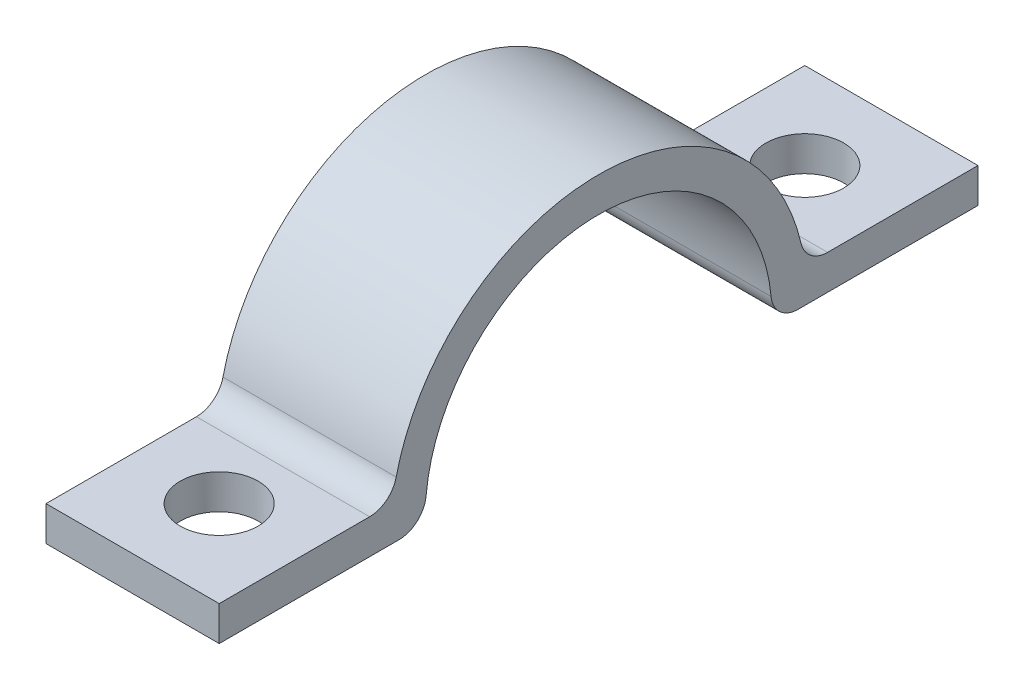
from build123d import *

# Parameters (mm, degrees)
BOSS_EXTRUDE1_DEPTH     = 31.75
CUT_EXTRUDE1_DEPTH      = 147.522740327
CUT_EXTRUDE1_DEPTH_BACK = 147.522740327
SKETCH2_R               = 7.14375
FILLET1_R               = 5


with BuildPart() as part:
    # Sketch1 → Boss-Extrude1 (new body)
    with BuildSketch(Plane(origin=(0, 0, 0), x_dir=(0, 0, -1), z_dir=(1, 0, 0))):
        with BuildLine():
            Line((0, 0), (0, 6.35))
            Line((0, 6.35), (31.75, 6.35))
            ThreePointArc((31.75, 6.35), (69.551171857, 39.6875), (107.352343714, 6.35))
            Line((107.352343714, 6.35), (139.102343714, 6.35))
            Line((139.102343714, 6.35), (139.102343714, 0))
            Line((139.102343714, 0), (101.301171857, 0))
            Line((101.301171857, 0), (101.301171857, 1.5875))
            ThreePointArc((101.301171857, 1.5875), (69.551171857, 33.3375), (37.801171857, 1.5875))
            Line((37.801171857, 1.5875), (37.801171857, 0))
            Line((37.801171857, 0), (0, 0))
        make_face()
    extrude(amount=BOSS_EXTRUDE1_DEPTH)

    # Sketch2 → Cut-Extrude1 (cut, two sides: drawn at the far end of the back side and taken through both)
    with BuildSketch(Plane(origin=(0, 6.35, 0), x_dir=(1, 0, 0), z_dir=(0, 1, 0)).offset(-CUT_EXTRUDE1_DEPTH_BACK)):
        with Locations(Location((15.875, 123.227343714, 0), (0, 0, 270))):
            Circle(SKETCH2_R)
        with Locations(Location((15.875, 15.875, 0), (0, 0, 270))):
            Circle(SKETCH2_R)
    extrude(amount=CUT_EXTRUDE1_DEPTH + CUT_EXTRUDE1_DEPTH_BACK, mode=Mode.SUBTRACT)

    # Fillet1
    fillet1_edges = [part.edges().sort_by_distance(p)[0] for p in [
        (15.875, 0, -101.301171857),
        (15.875, 0, -37.801171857),
        (15.875, 6.35, -107.352343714),
        (15.875, 6.35, -31.75),
    ]]
    fillet(fillet1_edges, radius=FILLET1_R)


solid = part.part
